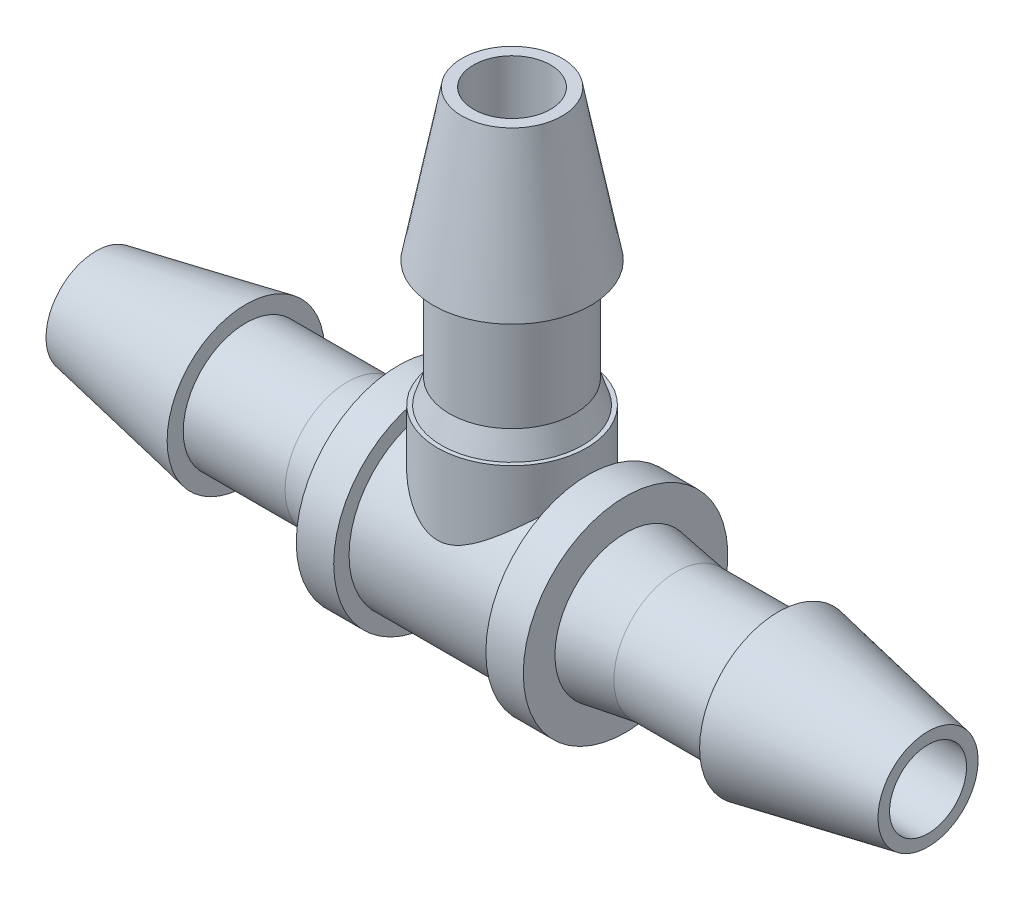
from build123d import *

# Parameters (mm, degrees)
CIRPATTERN1_COUNT  = 2
SKETCH9_R          = 1.1684
CUT_EXTRUDE2_DEPTH = 18.784257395
SKETCH10_R         = 1.1684
CUT_EXTRUDE3_DEPTH = 29.184406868


with BuildPart() as part:
    # Sketch1 → Revolve1 (revolve)
    with BuildSketch(Plane.XY, mode=Mode.PRIVATE) as revolve1_sk:
        Polygon((12.6238, 1.1684), (12.6238, 1.51892), (8.079232, 2.3876), (8.079232, 1.89865), (4.989406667, 1.89865), (3.444494, 2.143125), (3.444494, 3.10388), (2.308352, 3.10388), (2.308352, 2.638298), (0, 2.638298), (0, 1.1684), align=None)
    revolve(revolve1_sk.sketch.rotate(Axis((0, 0, 0), (1, 0, 0)), 90), axis=Axis((0, 0, 0), (1, 0, 0)))


with BuildPart() as cirpattern1_1:
    # CirPattern1: pattern copy
    add(part.part.rotate(Axis((0, 0, -3.063809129), (0, 0, 1)), 1 * 360 / CIRPATTERN1_COUNT))


with BuildPart() as part_1:
    add(part.part)

    add(cirpattern1_1.part)  # Revolve3 merges CirPattern1_1
    # Sketch8 → Revolve3 (revolve)
    with BuildSketch(Plane.XY, mode=Mode.PRIVATE) as revolve3_sk:
        Polygon((-1.1684, 12.13612), (-1.1684, 0), (-2.26218496, 0), (-2.26218496, 3.7855652), (-2.13518496, 3.7855652), (-1.89865, 4.501726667), (-1.89865, 7.591552), (-2.3876, 7.591552), (-1.51892, 12.13612), align=None)
    revolve(revolve3_sk.sketch.rotate(Axis((0, 0, 0), (0, -1, 0)), 270), axis=Axis((0, 0, 0), (0, -1, 0)))

    # Sketch9 → Cut-Extrude2 (cut, through all)
    with BuildSketch(Plane(origin=(0, 0, 0), x_dir=(1, 0, 0), z_dir=(0, 1, 0))):
        with Locations(Location((0, 0, 0), (0, 0, 270))):
            Circle(SKETCH9_R)
    extrude(amount=CUT_EXTRUDE2_DEPTH, mode=Mode.SUBTRACT)

    # Sketch10 → Cut-Extrude3 (cut, through all)
    with BuildSketch(Plane.ZY.offset(12.6238)):
        Circle(SKETCH10_R)
    extrude(amount=-CUT_EXTRUDE3_DEPTH, mode=Mode.SUBTRACT)


solid = part_1.part
